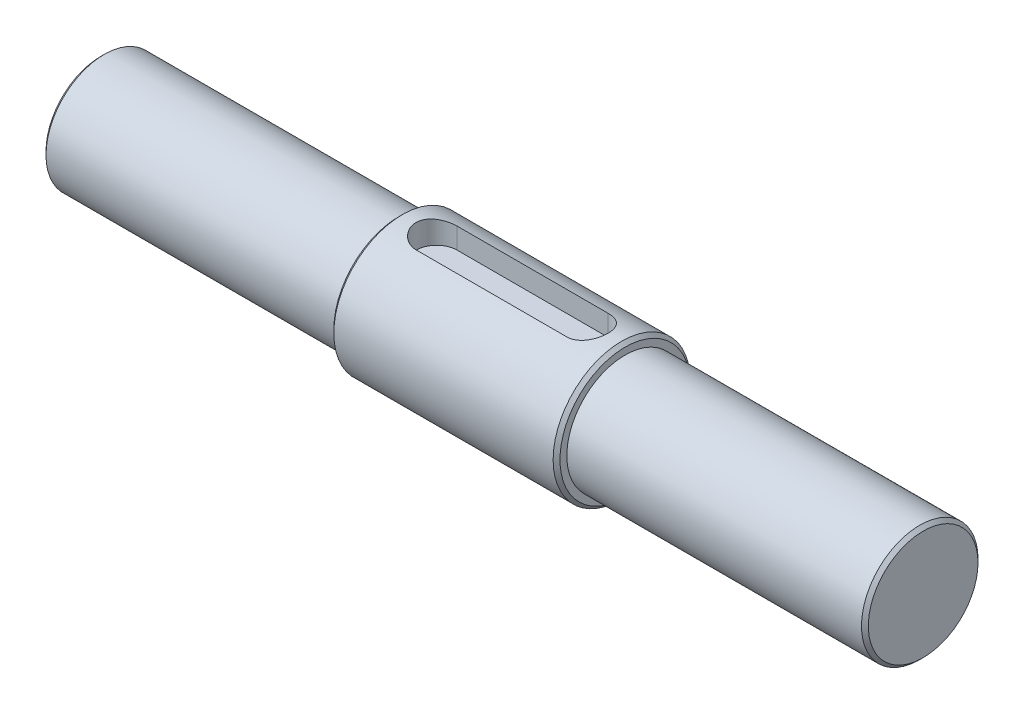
from build123d import *

# Parameters (mm, degrees)
SKETCH1_W               = 33
SKETCH1_H               = 10
SKETCH2_R               = 8.5
BOSS_EXTRUDE1_DEPTH     = 43.5
BOSS_EXTRUDE2_START     = 43.5
SKETCH3_R               = 8.5
BOSS_EXTRUDE2_DEPTH     = 43.5
CUT_EXTRUDE1_REACH      = 125.516
CUT_EXTRUDE1_END_RADIUS = 10
CHAMFER1_SIZE           = 0.5


with BuildPart() as part:
    # Sketch1 → Revolve1 (revolve)
    with BuildSketch(Plane(origin=(0, 0, 0), x_dir=(-1, 0, 0), z_dir=(0, 0, -1)), mode=Mode.PRIVATE) as revolve1_sk:
        with Locations((-62, 5)):
            Rectangle(SKETCH1_W, SKETCH1_H)
    revolve(revolve1_sk.sketch.rotate(Axis((78.5, 0, 0), (-1, 0, 0)), 270), axis=Axis((78.5, 0, 0), (-1, 0, 0)))

    # Sketch2 → Boss-Extrude1 (add)
    with BuildSketch(Plane(origin=(78.5, 0, 0), x_dir=(0, 0, -1), z_dir=(1, 0, 0))):
        Circle(SKETCH2_R)
    extrude(amount=BOSS_EXTRUDE1_DEPTH)

    # Sketch3 → Boss-Extrude2 (add)
    with BuildSketch(Plane.ZY.offset(-45.5).offset(BOSS_EXTRUDE2_START)):
        with Locations(Location((0, 0, 0), (0, 0, 180))):
            Circle(SKETCH3_R)
    extrude(amount=-BOSS_EXTRUDE2_DEPTH)

    # Cut-Extrude1: up to this cylinder (the profile starts inside it)
    cut_extrude1_end = Plane(origin=(62, 0, 0), z_dir=(-1, 0, 0)) * Cylinder(CUT_EXTRUDE1_END_RADIUS, 272.032, mode=Mode.PRIVATE)
    # Sketch4 → Cut-Extrude1 (cut, up to the surface)
    with BuildSketch(Plane.XZ.offset(-6.5), mode=Mode.PRIVATE) as cut_extrude1_sk1:
        with BuildLine():
            Line((73, 3), (51, 3))
            ThreePointArc((51, 3), (48, 0), (51, -3))
            Line((51, -3), (73, -3))
            ThreePointArc((73, -3), (76, 0), (73, 3))
        make_face()
    cut_extrude1_tool1 = extrude(cut_extrude1_sk1.sketch, amount=-CUT_EXTRUDE1_REACH, mode=Mode.PRIVATE) & cut_extrude1_end
    add(cut_extrude1_tool1.solids().sort_by_distance((62, 6.5, 0))[0], mode=Mode.SUBTRACT)

    # Chamfer1
    chamfer1_edges = [part.edges().sort_by_distance(p)[0] for p in [
        (122, 0, 8.5),
        (2, 0, 8.5),
        (45.5, 0, -10),
        (78.5, 0, -10),
    ]]
    chamfer(chamfer1_edges, length=CHAMFER1_SIZE)


solid = part.part
